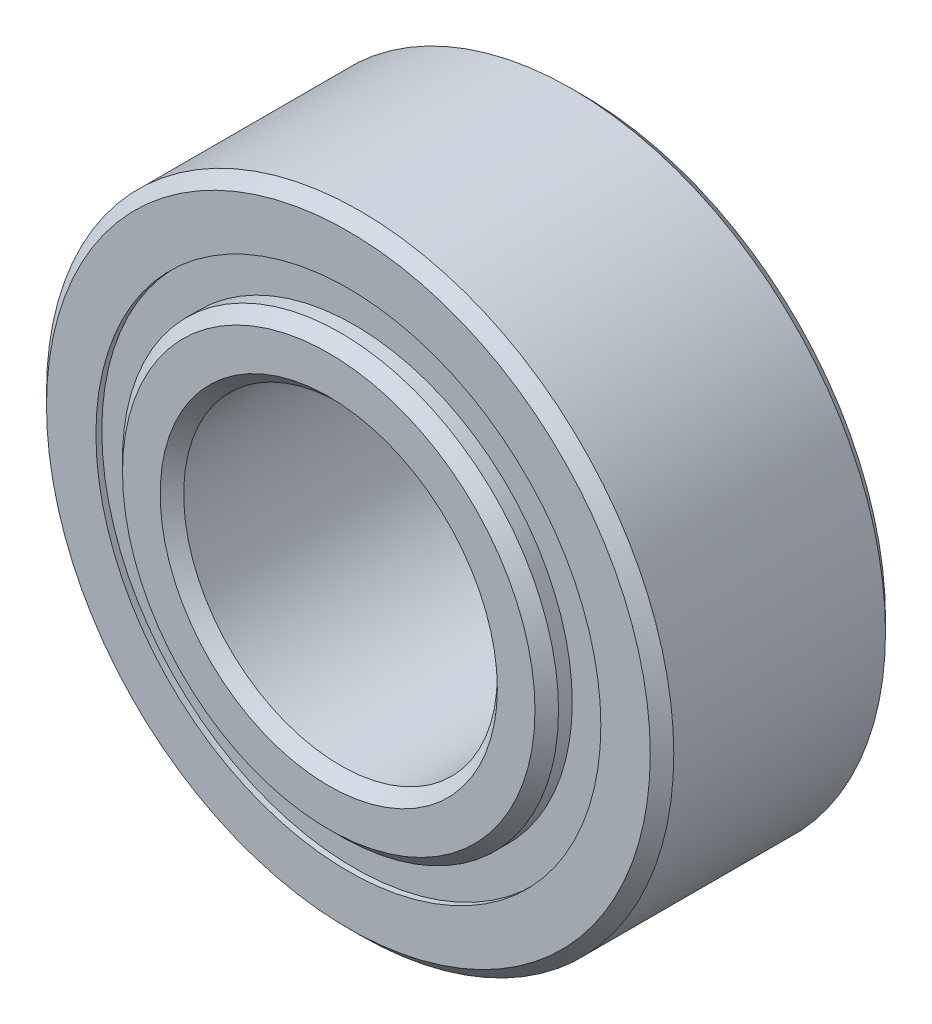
from build123d import *

# Parameters (mm, degrees)
CIRPATTERN1_COUNT = 10
SKETCH5_W         = 1.147826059
SKETCH5_H         = 0.697802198


with BuildPart() as part:
    # Sketch1 → Revolve1 (revolve)
    with BuildSketch(Plane(origin=(0, 0, 0), x_dir=(0, 0, -1), z_dir=(1, 0, 0)), mode=Mode.PRIVATE) as revolve1_sk:
        with BuildLine():
            Line((2.143125, 6.35), (-2.143125, 6.35))
            Line((-2.143125, 6.35), (-2.38125, 6.111875))
            Line((-2.38125, 6.111875), (-2.38125, 5.111401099))
            Line((-2.38125, 5.111401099), (-1.058333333, 5.111401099))
            ThreePointArc((-1.058333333, 5.111401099), (0, 5.876861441), (1.058333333, 5.111401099))
            Line((1.058333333, 5.111401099), (2.38125, 5.111401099))
            Line((2.38125, 5.111401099), (2.38125, 6.111875))
            Line((2.38125, 6.111875), (2.143125, 6.35))
        make_face()
    revolve(revolve1_sk.sketch.rotate(Axis((0, 0, 2.38125), (0, 0, -1)), 90), axis=Axis((0, 0, 2.38125), (0, 0, -1)))


with BuildPart() as body_2:
    # Sketch3 → Revolve3 (revolve)
    with BuildSketch(Plane(origin=(0, 0, 0), x_dir=(0, 0, -1), z_dir=(1, 0, 0)), mode=Mode.PRIVATE) as revolve3_sk:
        with BuildLine():
            Line((-2.77876, 3.413125), (-2.77876, 4.175473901))
            Line((-2.77876, 4.175473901), (-2.540635, 4.413598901))
            Line((-2.540635, 4.413598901), (-1.058333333, 4.413598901))
            ThreePointArc((-1.058333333, 4.413598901), (0, 3.648138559), (1.058333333, 4.413598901))
            Line((1.058333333, 4.413598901), (2.540635, 4.413598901))
            Line((2.540635, 4.413598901), (2.77876, 4.175473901))
            Line((2.77876, 4.175473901), (2.77876, 3.413125))
            Line((2.77876, 3.413125), (2.540635, 3.175))
            Line((2.540635, 3.175), (-2.540635, 3.175))
            Line((-2.540635, 3.175), (-2.77876, 3.413125))
        make_face()
    revolve(revolve3_sk.sketch.rotate(Axis((0, 0, 2.38125), (0, 0, -1)), 90), axis=Axis((0, 0, 2.38125), (0, 0, -1)))


with BuildPart() as body_3:
    # Sketch4 → Revolve4 (revolve)
    with BuildSketch(Plane(origin=(0, 0, 0), x_dir=(0, 0, -1), z_dir=(1, 0, 0))):
        with BuildLine():
            Line((-1.114361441, 4.7625), (1.114361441, 4.7625))
            ThreePointArc((1.114361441, 4.7625), (0, 5.876861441), (-1.114361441, 4.7625))
        make_face()
    revolve(axis=Axis((0, 4.7625, 1.114361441), (0, 0, -1)))


with BuildPart() as cirpattern1_1:
    # CirPattern1: pattern copy
    add(body_3.part.rotate(Axis((0, 0, 0), (0, 0, 1)), 1 * 360 / CIRPATTERN1_COUNT))


with BuildPart() as cirpattern1_2:
    # CirPattern1: pattern copy
    add(body_3.part.rotate(Axis((0, 0, 0), (0, 0, 1)), 2 * 360 / CIRPATTERN1_COUNT))


with BuildPart() as cirpattern1_3:
    # CirPattern1: pattern copy
    add(body_3.part.rotate(Axis((0, 0, 0), (0, 0, 1)), 3 * 360 / CIRPATTERN1_COUNT))


with BuildPart() as cirpattern1_4:
    # CirPattern1: pattern copy
    add(body_3.part.rotate(Axis((0, 0, 0), (0, 0, 1)), 4 * 360 / CIRPATTERN1_COUNT))


with BuildPart() as cirpattern1_5:
    # CirPattern1: pattern copy
    add(body_3.part.rotate(Axis((0, 0, 0), (0, 0, 1)), 5 * 360 / CIRPATTERN1_COUNT))


with BuildPart() as cirpattern1_6:
    # CirPattern1: pattern copy
    add(body_3.part.rotate(Axis((0, 0, 0), (0, 0, 1)), 6 * 360 / CIRPATTERN1_COUNT))


with BuildPart() as cirpattern1_7:
    # CirPattern1: pattern copy
    add(body_3.part.rotate(Axis((0, 0, 0), (0, 0, 1)), 7 * 360 / CIRPATTERN1_COUNT))


with BuildPart() as cirpattern1_8:
    # CirPattern1: pattern copy
    add(body_3.part.rotate(Axis((0, 0, 0), (0, 0, 1)), 8 * 360 / CIRPATTERN1_COUNT))


with BuildPart() as cirpattern1_9:
    # CirPattern1: pattern copy
    add(body_3.part.rotate(Axis((0, 0, 0), (0, 0, 1)), 9 * 360 / CIRPATTERN1_COUNT))


with BuildPart() as body_13:
    # Sketch5 → Revolve5 (revolve)
    with BuildSketch(Plane(origin=(0, 0, 0), x_dir=(0, 0, -1), z_dir=(1, 0, 0)), mode=Mode.PRIVATE) as revolve5_sk:
        with Locations((-1.688274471, 4.7625)):
            Rectangle(SKETCH5_W, SKETCH5_H)
        with Locations((1.688274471, 4.7625)):
            Rectangle(SKETCH5_W, SKETCH5_H)
    revolve(revolve5_sk.sketch.rotate(Axis((0, 0, 2.38125), (0, 0, -1)), 90), axis=Axis((0, 0, 2.38125), (0, 0, -1)))


solid = Compound([part.part, body_2.part, body_3.part, cirpattern1_1.part, cirpattern1_2.part, cirpattern1_3.part, cirpattern1_4.part, cirpattern1_5.part, cirpattern1_6.part, cirpattern1_7.part, cirpattern1_8.part, cirpattern1_9.part, body_13.part])
